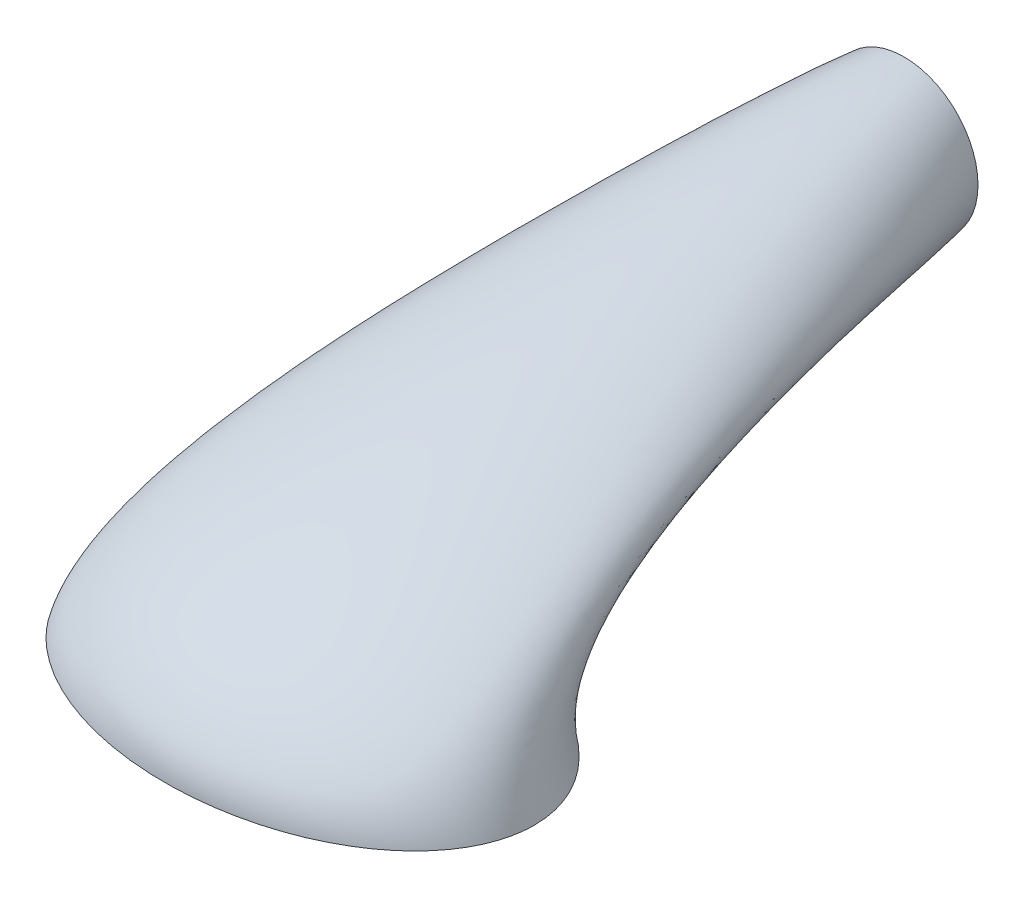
ISO-10303-21;
HEADER;
FILE_DESCRIPTION(('STEP AP214'),'2;1');
FILE_NAME('part.step','',(''),(''),'','','');
FILE_SCHEMA(('AUTOMOTIVE_DESIGN { 1 0 10303 214 1 1 1 1 }'));
ENDSEC;
DATA;
#1=APPLICATION_CONTEXT('core data for automotive mechanical design processes');
#2=APPLICATION_PROTOCOL_DEFINITION('international standard','automotive_design',2000,#1);
#3=PRODUCT_CONTEXT('',#1,'mechanical');
#4=PRODUCT('Part','Part','',(#3));
#5=PRODUCT_RELATED_PRODUCT_CATEGORY('part','',(#4));
#6=PRODUCT_DEFINITION_FORMATION('','',#4);
#7=PRODUCT_DEFINITION_CONTEXT('part definition',#1,'design');
#8=PRODUCT_DEFINITION('design','',#6,#7);
#9=PRODUCT_DEFINITION_SHAPE('','',#8);
#10=(LENGTH_UNIT() NAMED_UNIT(*) SI_UNIT(.MILLI.,.METRE.));
#11=(NAMED_UNIT(*) PLANE_ANGLE_UNIT() SI_UNIT($,.RADIAN.));
#12=(NAMED_UNIT(*) SI_UNIT($,.STERADIAN.) SOLID_ANGLE_UNIT());
#13=UNCERTAINTY_MEASURE_WITH_UNIT(LENGTH_MEASURE(1.E-05),#10,'distance_accuracy_value','');
#14=(GEOMETRIC_REPRESENTATION_CONTEXT(3) GLOBAL_UNCERTAINTY_ASSIGNED_CONTEXT((#13)) GLOBAL_UNIT_ASSIGNED_CONTEXT((#10,
#11,#12)) REPRESENTATION_CONTEXT('',''));
#15=CARTESIAN_POINT('',(0.,0.,0.));
#16=DIRECTION('',(0.,0.,1.));
#17=DIRECTION('',(1.,0.,0.));
#18=AXIS2_PLACEMENT_3D('',#15,#16,#17);
#19=CARTESIAN_POINT('',(0.,0.,0.));
#20=DIRECTION('',(0.,1.,0.));
#21=DIRECTION('',(0.,0.,1.));
#22=AXIS2_PLACEMENT_3D('',#19,#20,#21);
#23=PLANE('',#22);
#24=CARTESIAN_POINT('',(0.,0.,0.));
#25=DIRECTION('',(0.,1.,0.));
#26=DIRECTION('',(1.,0.,0.));
#27=AXIS2_PLACEMENT_3D('',#24,#25,#26);
#28=ELLIPSE('',#27,60.,40.);
#29=CARTESIAN_POINT('',(60.,0.,0.));
#30=VERTEX_POINT('',#29);
#31=EDGE_CURVE('E93',#30,#30,#28,.T.);
#32=ORIENTED_EDGE('',*,*,#31,.F.);
#33=EDGE_LOOP('',(#32));
#34=FACE_BOUND('',#33,.T.);
#35=ADVANCED_FACE('F85',(#34),#23,.F.);
#36=CARTESIAN_POINT('',(0.,50.,-160.));
#37=DIRECTION('',(0.,0.,1.));
#38=DIRECTION('',(1.,0.,0.));
#39=AXIS2_PLACEMENT_3D('',#36,#37,#38);
#40=PLANE('',#39);
#41=CARTESIAN_POINT('',(0.,50.,-160.));
#42=DIRECTION('',(0.,0.,1.));
#43=DIRECTION('',(1.,0.,0.));
#44=AXIS2_PLACEMENT_3D('',#41,#42,#43);
#45=CIRCLE('',#44,20.);
#46=CARTESIAN_POINT('',(20.,50.,-160.));
#47=VERTEX_POINT('',#46);
#48=EDGE_CURVE('E12',#47,#47,#45,.T.);
#49=ORIENTED_EDGE('',*,*,#48,.F.);
#50=EDGE_LOOP('',(#49));
#51=FACE_BOUND('',#50,.T.);
#52=ADVANCED_FACE('F135',(#51),#40,.F.);
#53=CARTESIAN_POINT('',(0.,70.,-160.));
#54=CARTESIAN_POINT('',(0.,70.,-109.822632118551));
#55=CARTESIAN_POINT('',(0.,42.0647648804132,40.));
#56=CARTESIAN_POINT('',(0.,0.,40.));
#57=CARTESIAN_POINT('',(-1.30899692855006,70.,-160.));
#58=CARTESIAN_POINT('',(-1.97443122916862,70.,-109.822632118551));
#59=CARTESIAN_POINT('',(-2.63986552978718,42.0647648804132,40.));
#60=CARTESIAN_POINT('',(-3.30529983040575,0.,40.));
#61=CARTESIAN_POINT('',(-3.92673305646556,69.7399685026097,-160.));
#62=CARTESIAN_POINT('',(-5.92313915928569,69.7224790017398,-109.883224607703));
#63=CARTESIAN_POINT('',(-7.91954526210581,42.0685553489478,39.5495445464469));
#64=CARTESIAN_POINT('',(-9.91595136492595,0.,39.6368168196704));
#65=CARTESIAN_POINT('',(-7.70364233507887,68.5987303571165,-160.));
#66=CARTESIAN_POINT('',(-11.7057414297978,68.531966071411,-110.184646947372));
#67=CARTESIAN_POINT('',(-15.7078405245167,42.0613216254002,37.5884591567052));
#68=CARTESIAN_POINT('',(-19.7099396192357,0.,37.9842512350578));
#69=CARTESIAN_POINT('',(-11.1819349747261,66.7352049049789,-160.));
#70=CARTESIAN_POINT('',(-17.2005886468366,66.6255532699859,-110.737829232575));
#71=CARTESIAN_POINT('',(-23.219242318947,42.01687764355,34.3829953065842));
#72=CARTESIAN_POINT('',(-29.2378959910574,0.,35.1682429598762));
#73=CARTESIAN_POINT('',(-14.2347078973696,64.2345535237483,-160.));
#74=CARTESIAN_POINT('',(-22.2583017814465,64.0990773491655,-111.598408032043));
#75=CARTESIAN_POINT('',(-30.2818956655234,41.9296851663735,29.9453562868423));
#76=CARTESIAN_POINT('',(-38.3054895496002,0.,31.0899094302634));
#77=CARTESIAN_POINT('',(-16.7350580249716,61.1819375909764,-160.));
#78=CARTESIAN_POINT('',(-26.6954454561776,61.0483750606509,-112.834751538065));
#79=CARTESIAN_POINT('',(-36.6558328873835,41.7942059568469,24.2622821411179));
#80=CARTESIAN_POINT('',(-46.6162203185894,0.,25.6121732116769));
#81=CARTESIAN_POINT('',(-18.2878802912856,58.283507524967,-160.));
#82=CARTESIAN_POINT('',(-29.6956200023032,58.1720779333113,-114.242695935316));
#83=CARTESIAN_POINT('',(-41.1033597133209,41.6479255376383,18.4623796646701));
#84=CARTESIAN_POINT('',(-52.5110994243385,0.,19.7443507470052));
#85=CARTESIAN_POINT('',(-19.1693860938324,55.815245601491,-160.));
#86=CARTESIAN_POINT('',(-31.5165519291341,55.732299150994,-115.61577240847));
#87=CARTESIAN_POINT('',(-43.8637177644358,41.5149872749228,13.2055393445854));
#88=CARTESIAN_POINT('',(-56.2108835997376,0.,14.2419027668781));
#89=CARTESIAN_POINT('',(-19.6464127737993,53.9079799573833,-160.));
#90=CARTESIAN_POINT('',(-32.5438787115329,53.8504371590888,-116.75930203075));
#91=CARTESIAN_POINT('',(-45.4413446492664,41.4093158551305,8.98916090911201));
#92=CARTESIAN_POINT('',(-58.338810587,0.,9.74838980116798));
#93=CARTESIAN_POINT('',(-19.9356101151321,51.9633348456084,-160.));
#94=CARTESIAN_POINT('',(-33.1873316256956,51.9338898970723,-117.996258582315));
#95=CARTESIAN_POINT('',(-46.4390531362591,41.299665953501,4.55505950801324));
#96=CARTESIAN_POINT('',(-59.6907746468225,0.,4.95758926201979));
#97=CARTESIAN_POINT('',(-20.0332514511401,50.,-160.));
#98=CARTESIAN_POINT('',(-33.4070686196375,50.,-119.285976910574));
#99=CARTESIAN_POINT('',(-46.780885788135,41.188026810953,0.));
#100=CARTESIAN_POINT('',(-60.1547029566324,0.,0.));
#101=CARTESIAN_POINT('',(-19.9356101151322,48.0366651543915,-160.));
#102=CARTESIAN_POINT('',(-33.1873316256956,48.0661101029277,-120.575695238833));
#103=CARTESIAN_POINT('',(-46.439053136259,41.0763876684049,-4.55505950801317));
#104=CARTESIAN_POINT('',(-59.6907746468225,0.,-4.95758926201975));
#105=CARTESIAN_POINT('',(-19.6464127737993,46.0920200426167,-160.));
#106=CARTESIAN_POINT('',(-32.5438787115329,46.1495628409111,-121.812651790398));
#107=CARTESIAN_POINT('',(-45.4413446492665,40.9667377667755,-8.98916090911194));
#108=CARTESIAN_POINT('',(-58.3388105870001,0.,-9.74838980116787));
#109=CARTESIAN_POINT('',(-19.1693860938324,44.184754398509,-160.));
#110=CARTESIAN_POINT('',(-31.5165519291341,44.267700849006,-122.956181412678));
#111=CARTESIAN_POINT('',(-43.8637177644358,40.8610663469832,-13.2055393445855));
#112=CARTESIAN_POINT('',(-56.2108835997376,0.,-14.2419027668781));
#113=CARTESIAN_POINT('',(-18.2878802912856,41.7164924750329,-160.));
#114=CARTESIAN_POINT('',(-29.6956200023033,41.8279220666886,-124.329257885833));
#115=CARTESIAN_POINT('',(-41.103359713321,40.7281280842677,-18.4623796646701));
#116=CARTESIAN_POINT('',(-52.5110994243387,0.,-19.7443507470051));
#117=CARTESIAN_POINT('',(-16.7350580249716,38.8180624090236,-160.));
#118=CARTESIAN_POINT('',(-26.6954454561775,38.9516249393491,-125.737202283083));
#119=CARTESIAN_POINT('',(-36.6558328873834,40.5818476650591,-24.2622821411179));
#120=CARTESIAN_POINT('',(-46.6162203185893,0.,-25.6121732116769));
#121=CARTESIAN_POINT('',(-14.2347078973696,35.7654464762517,-160.));
#122=CARTESIAN_POINT('',(-22.2583017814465,35.9009226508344,-126.973545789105));
#123=CARTESIAN_POINT('',(-30.2818956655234,40.4463684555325,-29.945356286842));
#124=CARTESIAN_POINT('',(-38.3054895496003,0.,-31.0899094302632));
#125=CARTESIAN_POINT('',(-11.1819349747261,33.2647950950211,-160.));
#126=CARTESIAN_POINT('',(-17.2005886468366,33.374446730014,-127.834124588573));
#127=CARTESIAN_POINT('',(-23.219242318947,40.3591759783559,-34.3829953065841));
#128=CARTESIAN_POINT('',(-29.2378959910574,0.,-35.1682429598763));
#129=CARTESIAN_POINT('',(-7.70364233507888,31.4012696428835,-160.));
#130=CARTESIAN_POINT('',(-11.7057414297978,31.468033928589,-128.387306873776));
#131=CARTESIAN_POINT('',(-15.7078405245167,40.3147319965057,-37.5884591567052));
#132=CARTESIAN_POINT('',(-19.7099396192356,0.,-37.9842512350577));
#133=CARTESIAN_POINT('',(-3.92673305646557,30.2600314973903,-160.));
#134=CARTESIAN_POINT('',(-5.92313915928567,30.2775209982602,-128.688729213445));
#135=CARTESIAN_POINT('',(-7.91954526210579,40.3074982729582,-39.549544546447));
#136=CARTESIAN_POINT('',(-9.91595136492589,0.,-39.6368168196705));
#137=CARTESIAN_POINT('',(-1.30899692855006,30.,-160.));
#138=CARTESIAN_POINT('',(-1.97443122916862,30.,-128.749321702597));
#139=CARTESIAN_POINT('',(-2.63986552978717,40.3112887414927,-40.));
#140=CARTESIAN_POINT('',(-3.30529983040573,0.,-40.));
#141=CARTESIAN_POINT('',(1.30899692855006,30.,-160.));
#142=CARTESIAN_POINT('',(1.97443122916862,30.,-128.749321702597));
#143=CARTESIAN_POINT('',(2.63986552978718,40.3112887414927,-40.));
#144=CARTESIAN_POINT('',(3.30529983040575,0.,-40.));
#145=CARTESIAN_POINT('',(3.92673305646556,30.2600314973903,-160.));
#146=CARTESIAN_POINT('',(5.92313915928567,30.2775209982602,-128.688729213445));
#147=CARTESIAN_POINT('',(7.91954526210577,40.3074982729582,-39.5495445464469));
#148=CARTESIAN_POINT('',(9.91595136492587,0.,-39.6368168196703));
#149=CARTESIAN_POINT('',(7.70364233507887,31.4012696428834,-160.));
#150=CARTESIAN_POINT('',(11.7057414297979,31.4680339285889,-128.387306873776));
#151=CARTESIAN_POINT('',(15.7078405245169,40.3147319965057,-37.5884591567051));
#152=CARTESIAN_POINT('',(19.7099396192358,0.,-37.9842512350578));
#153=CARTESIAN_POINT('',(11.1819349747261,33.264795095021,-160.));
#154=CARTESIAN_POINT('',(17.2005886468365,33.374446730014,-127.834124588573));
#155=CARTESIAN_POINT('',(23.2192423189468,40.3591759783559,-34.382995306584));
#156=CARTESIAN_POINT('',(29.2378959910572,0.,-35.1682429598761));
#157=CARTESIAN_POINT('',(14.2347078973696,35.7654464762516,-160.));
#158=CARTESIAN_POINT('',(22.2583017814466,35.9009226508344,-126.973545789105));
#159=CARTESIAN_POINT('',(30.2818956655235,40.4463684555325,-29.9453562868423));
#160=CARTESIAN_POINT('',(38.3054895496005,0.,-31.0899094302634));
#161=CARTESIAN_POINT('',(16.7350580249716,38.8180624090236,-160.));
#162=CARTESIAN_POINT('',(26.6954454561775,38.9516249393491,-125.737202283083));
#163=CARTESIAN_POINT('',(36.6558328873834,40.5818476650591,-24.2622821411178));
#164=CARTESIAN_POINT('',(46.6162203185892,0.,-25.6121732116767));
#165=CARTESIAN_POINT('',(18.2878802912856,41.716492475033,-160.));
#166=CARTESIAN_POINT('',(29.6956200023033,41.8279220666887,-124.329257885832));
#167=CARTESIAN_POINT('',(41.103359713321,40.7281280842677,-18.4623796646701));
#168=CARTESIAN_POINT('',(52.5110994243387,0.,-19.7443507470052));
#169=CARTESIAN_POINT('',(19.1693860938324,44.184754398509,-160.));
#170=CARTESIAN_POINT('',(31.5165519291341,44.267700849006,-122.956181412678));
#171=CARTESIAN_POINT('',(43.8637177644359,40.8610663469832,-13.2055393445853));
#172=CARTESIAN_POINT('',(56.2108835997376,0.,-14.241902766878));
#173=CARTESIAN_POINT('',(19.6464127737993,46.0920200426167,-160.));
#174=CARTESIAN_POINT('',(32.5438787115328,46.1495628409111,-121.812651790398));
#175=CARTESIAN_POINT('',(45.4413446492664,40.9667377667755,-8.98916090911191));
#176=CARTESIAN_POINT('',(58.338810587,0.,-9.74838980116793));
#177=CARTESIAN_POINT('',(19.9356101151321,48.0366651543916,-160.));
#178=CARTESIAN_POINT('',(33.1873316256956,48.0661101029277,-120.575695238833));
#179=CARTESIAN_POINT('',(46.4390531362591,41.0763876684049,-4.55505950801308));
#180=CARTESIAN_POINT('',(59.6907746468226,0.,-4.95758926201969));
#181=CARTESIAN_POINT('',(20.03325145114,50.,-160.));
#182=CARTESIAN_POINT('',(33.4070686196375,50.,-119.285976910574));
#183=CARTESIAN_POINT('',(46.7808857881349,41.188026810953,0.));
#184=CARTESIAN_POINT('',(60.1547029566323,0.,0.));
#185=CARTESIAN_POINT('',(19.9356101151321,51.9633348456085,-160.));
#186=CARTESIAN_POINT('',(33.1873316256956,51.9338898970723,-117.996258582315));
#187=CARTESIAN_POINT('',(46.4390531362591,41.299665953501,4.55505950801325));
#188=CARTESIAN_POINT('',(59.6907746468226,0.,4.95758926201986));
#189=CARTESIAN_POINT('',(19.6464127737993,53.9079799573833,-160.));
#190=CARTESIAN_POINT('',(32.5438787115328,53.8504371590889,-116.75930203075));
#191=CARTESIAN_POINT('',(45.4413446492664,41.4093158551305,8.98916090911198));
#192=CARTESIAN_POINT('',(58.3388105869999,0.,9.74838980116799));
#193=CARTESIAN_POINT('',(19.1693860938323,55.8152456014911,-160.));
#194=CARTESIAN_POINT('',(31.5165519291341,55.7322991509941,-115.61577240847));
#195=CARTESIAN_POINT('',(43.8637177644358,41.5149872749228,13.2055393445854));
#196=CARTESIAN_POINT('',(56.2108835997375,0.,14.2419027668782));
#197=CARTESIAN_POINT('',(18.2878802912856,58.2835075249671,-160.));
#198=CARTESIAN_POINT('',(29.6956200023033,58.1720779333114,-114.242695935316));
#199=CARTESIAN_POINT('',(41.103359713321,41.6479255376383,18.46237966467));
#200=CARTESIAN_POINT('',(52.5110994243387,0.,19.7443507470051));
#201=CARTESIAN_POINT('',(16.7350580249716,61.1819375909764,-160.));
#202=CARTESIAN_POINT('',(26.6954454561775,61.0483750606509,-112.834751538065));
#203=CARTESIAN_POINT('',(36.6558328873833,41.7942059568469,24.262282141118));
#204=CARTESIAN_POINT('',(46.6162203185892,0.,25.612173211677));
#205=CARTESIAN_POINT('',(14.2347078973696,64.2345535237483,-160.));
#206=CARTESIAN_POINT('',(22.2583017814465,64.0990773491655,-111.598408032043));
#207=CARTESIAN_POINT('',(30.2818956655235,41.9296851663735,29.9453562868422));
#208=CARTESIAN_POINT('',(38.3054895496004,0.,31.0899094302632));
#209=CARTESIAN_POINT('',(11.1819349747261,66.7352049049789,-160.));
#210=CARTESIAN_POINT('',(17.2005886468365,66.6255532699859,-110.737829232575));
#211=CARTESIAN_POINT('',(23.2192423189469,42.0168776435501,34.3829953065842));
#212=CARTESIAN_POINT('',(29.2378959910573,0.,35.1682429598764));
#213=CARTESIAN_POINT('',(7.70364233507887,68.5987303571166,-160.));
#214=CARTESIAN_POINT('',(11.7057414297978,68.531966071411,-110.184646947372));
#215=CARTESIAN_POINT('',(15.7078405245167,42.0613216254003,37.588459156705));
#216=CARTESIAN_POINT('',(19.7099396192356,0.,37.9842512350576));
#217=CARTESIAN_POINT('',(3.92673305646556,69.7399685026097,-160.));
#218=CARTESIAN_POINT('',(5.92313915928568,69.7224790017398,-109.883224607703));
#219=CARTESIAN_POINT('',(7.91954526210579,42.0685553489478,39.549544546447));
#220=CARTESIAN_POINT('',(9.91595136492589,0.,39.6368168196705));
#221=CARTESIAN_POINT('',(1.30899692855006,70.,-160.));
#222=CARTESIAN_POINT('',(1.97443122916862,70.,-109.822632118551));
#223=CARTESIAN_POINT('',(2.63986552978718,42.0647648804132,40.));
#224=CARTESIAN_POINT('',(3.30529983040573,0.,40.));
#225=CARTESIAN_POINT('',(0.,70.,-160.));
#226=CARTESIAN_POINT('',(0.,70.,-109.822632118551));
#227=CARTESIAN_POINT('',(0.,42.0647648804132,40.));
#228=CARTESIAN_POINT('',(0.,0.,40.));
#229=B_SPLINE_SURFACE_WITH_KNOTS('',3,3,((#53,#54,#55,#56),(#57,#58,#59,#60),(#61,#62,#63,#64),
(#65,#66,#67,#68),(#69,#70,#71,#72),(#73,#74,#75,#76),(#77,#78,#79,#80),(#81,#82,#83,#84),(#85,
#86,#87,#88),(#89,#90,#91,#92),(#93,#94,#95,#96),(#97,#98,#99,#100),(#101,#102,#103,#104),(#105,
#106,#107,#108),(#109,#110,#111,#112),(#113,#114,#115,#116),(#117,#118,#119,#120),(#121,#122,
#123,#124),(#125,#126,#127,#128),(#129,#130,#131,#132),(#133,#134,#135,#136),(#137,#138,#139,
#140),(#141,#142,#143,#144),(#145,#146,#147,#148),(#149,#150,#151,#152),(#153,#154,#155,#156),
(#157,#158,#159,#160),(#161,#162,#163,#164),(#165,#166,#167,#168),(#169,#170,#171,#172),(#173,
#174,#175,#176),(#177,#178,#179,#180),(#181,#182,#183,#184),(#185,#186,#187,#188),(#189,#190,
#191,#192),(#193,#194,#195,#196),(#197,#198,#199,#200),(#201,#202,#203,#204),(#205,#206,#207,
#208),(#209,#210,#211,#212),(#213,#214,#215,#216),(#217,#218,#219,#220),(#221,#222,#223,#224),
(#225,#226,#227,#228)),.UNSPECIFIED.,.T.,.F.,.F.,(4,1,1,1,1,1,1,1,1,1,1,1,1,1,1,1,1,1,1,1,2,1,1,
1,1,1,1,1,1,1,1,1,1,1,1,1,1,1,1,1,4),(4,4),(0.,0.03125,0.0625,0.09375,0.125,0.15625,0.1875,
0.203125,0.21875,0.234375,0.25,0.265625,0.28125,0.296875,0.3125,0.34375,0.375,0.40625,0.4375,
0.46875,0.5,0.53125,0.5625,0.59375,0.625,0.65625,0.6875,0.703125,0.71875,0.734375,0.75,0.765625,
0.78125,0.796875,0.8125,0.84375,0.875,0.90625,0.9375,0.96875,1.),(0.,1.),.UNSPECIFIED.);
#230=ORIENTED_EDGE('',*,*,#48,.T.);
#231=EDGE_LOOP('',(#230));
#232=FACE_BOUND('',#231,.T.);
#233=ORIENTED_EDGE('',*,*,#31,.T.);
#234=EDGE_LOOP('',(#233));
#235=FACE_BOUND('',#234,.T.);
#236=ADVANCED_FACE('F119',(#232,#235),#229,.T.);
#237=CLOSED_SHELL('',(#35,#52,#236));
#238=MANIFOLD_SOLID_BREP('B2',#237);
#239=ADVANCED_BREP_SHAPE_REPRESENTATION('',(#18,#238),#14);
#240=SHAPE_DEFINITION_REPRESENTATION(#9,#239);
ENDSEC;
END-ISO-10303-21;
